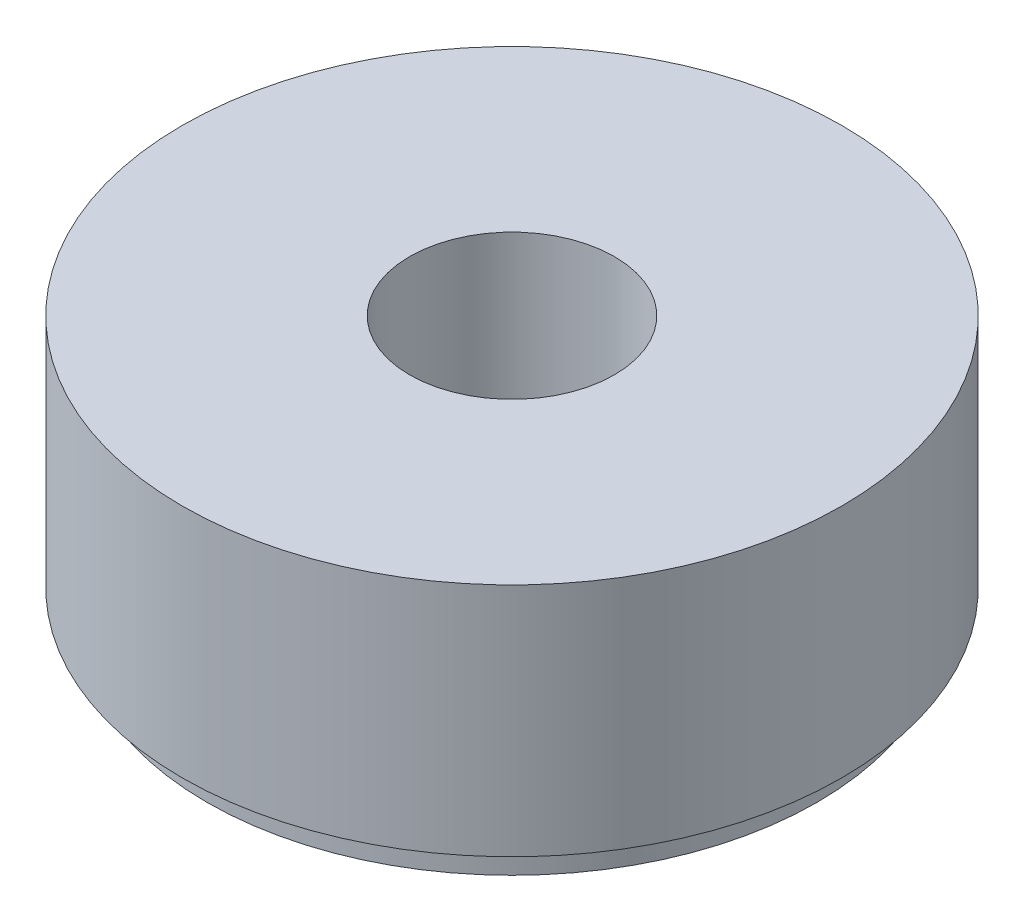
ISO-10303-21;
HEADER;
FILE_DESCRIPTION(('STEP AP214'),'2;1');
FILE_NAME('part.step','',(''),(''),'','','');
FILE_SCHEMA(('AUTOMOTIVE_DESIGN { 1 0 10303 214 1 1 1 1 }'));
ENDSEC;
DATA;
#1=APPLICATION_CONTEXT('core data for automotive mechanical design processes');
#2=APPLICATION_PROTOCOL_DEFINITION('international standard','automotive_design',2000,#1);
#3=PRODUCT_CONTEXT('',#1,'mechanical');
#4=PRODUCT('Part','Part','',(#3));
#5=PRODUCT_RELATED_PRODUCT_CATEGORY('part','',(#4));
#6=PRODUCT_DEFINITION_FORMATION('','',#4);
#7=PRODUCT_DEFINITION_CONTEXT('part definition',#1,'design');
#8=PRODUCT_DEFINITION('design','',#6,#7);
#9=PRODUCT_DEFINITION_SHAPE('','',#8);
#10=(LENGTH_UNIT() NAMED_UNIT(*) SI_UNIT(.MILLI.,.METRE.));
#11=(NAMED_UNIT(*) PLANE_ANGLE_UNIT() SI_UNIT($,.RADIAN.));
#12=(NAMED_UNIT(*) SI_UNIT($,.STERADIAN.) SOLID_ANGLE_UNIT());
#13=UNCERTAINTY_MEASURE_WITH_UNIT(LENGTH_MEASURE(1.E-05),#10,'distance_accuracy_value','');
#14=(GEOMETRIC_REPRESENTATION_CONTEXT(3) GLOBAL_UNCERTAINTY_ASSIGNED_CONTEXT((#13)) GLOBAL_UNIT_ASSIGNED_CONTEXT((#10,
#11,#12)) REPRESENTATION_CONTEXT('',''));
#15=CARTESIAN_POINT('',(0.,0.,0.));
#16=DIRECTION('',(0.,0.,1.));
#17=DIRECTION('',(1.,0.,0.));
#18=AXIS2_PLACEMENT_3D('',#15,#16,#17);
#19=CARTESIAN_POINT('',(0.,2.,0.));
#20=DIRECTION('',(0.,-1.,0.));
#21=DIRECTION('',(0.,0.,-1.));
#22=AXIS2_PLACEMENT_3D('',#19,#20,#21);
#23=CYLINDRICAL_SURFACE('',#22,14.49);
#24=CARTESIAN_POINT('',(0.,2.,0.));
#25=DIRECTION('',(0.,1.,0.));
#26=DIRECTION('',(0.,0.,1.));
#27=AXIS2_PLACEMENT_3D('',#24,#25,#26);
#28=CIRCLE('',#27,14.49);
#29=CARTESIAN_POINT('',(0.,2.,14.49));
#30=VERTEX_POINT('',#29);
#31=EDGE_CURVE('E10',#30,#30,#28,.T.);
#32=ORIENTED_EDGE('',*,*,#31,.F.);
#33=EDGE_LOOP('',(#32));
#34=FACE_BOUND('',#33,.T.);
#35=CARTESIAN_POINT('',(0.,0.,0.));
#36=DIRECTION('',(0.,1.,0.));
#37=DIRECTION('',(0.,0.,1.));
#38=AXIS2_PLACEMENT_3D('',#35,#36,#37);
#39=CIRCLE('',#38,14.49);
#40=CARTESIAN_POINT('',(0.,0.,14.49));
#41=VERTEX_POINT('',#40);
#42=EDGE_CURVE('E46',#41,#41,#39,.T.);
#43=ORIENTED_EDGE('',*,*,#42,.T.);
#44=EDGE_LOOP('',(#43));
#45=FACE_BOUND('',#44,.T.);
#46=ADVANCED_FACE('F43',(#34,#45),#23,.T.);
#47=CARTESIAN_POINT('',(0.,0.,0.));
#48=DIRECTION('',(0.,1.,0.));
#49=DIRECTION('',(0.,0.,1.));
#50=AXIS2_PLACEMENT_3D('',#47,#48,#49);
#51=PLANE('',#50);
#52=CARTESIAN_POINT('',(0.,0.,0.));
#53=DIRECTION('',(0.,-1.,0.));
#54=DIRECTION('',(0.,0.,-1.));
#55=AXIS2_PLACEMENT_3D('',#52,#53,#54);
#56=CIRCLE('',#55,6.13);
#57=CARTESIAN_POINT('',(0.,0.,-6.13));
#58=VERTEX_POINT('',#57);
#59=EDGE_CURVE('E69',#58,#58,#56,.T.);
#60=ORIENTED_EDGE('',*,*,#59,.F.);
#61=EDGE_LOOP('',(#60));
#62=FACE_BOUND('',#61,.T.);
#63=ORIENTED_EDGE('',*,*,#42,.F.);
#64=EDGE_LOOP('',(#63));
#65=FACE_BOUND('',#64,.T.);
#66=ADVANCED_FACE('F83',(#62,#65),#51,.F.);
#67=CARTESIAN_POINT('',(0.,4.,0.));
#68=DIRECTION('',(0.,-1.,0.));
#69=DIRECTION('',(0.,0.,-1.));
#70=AXIS2_PLACEMENT_3D('',#67,#68,#69);
#71=CYLINDRICAL_SURFACE('',#70,18.26);
#72=CARTESIAN_POINT('',(0.,4.,0.));
#73=DIRECTION('',(0.,1.,0.));
#74=DIRECTION('',(0.,0.,1.));
#75=AXIS2_PLACEMENT_3D('',#72,#73,#74);
#76=CIRCLE('',#75,18.26);
#77=CARTESIAN_POINT('',(0.,4.,18.26));
#78=VERTEX_POINT('',#77);
#79=EDGE_CURVE('E55',#78,#78,#76,.T.);
#80=ORIENTED_EDGE('',*,*,#79,.F.);
#81=EDGE_LOOP('',(#80));
#82=FACE_BOUND('',#81,.T.);
#83=CARTESIAN_POINT('',(0.,2.,0.));
#84=DIRECTION('',(0.,1.,0.));
#85=DIRECTION('',(0.,0.,1.));
#86=AXIS2_PLACEMENT_3D('',#83,#84,#85);
#87=CIRCLE('',#86,18.26);
#88=CARTESIAN_POINT('',(0.,2.,18.26));
#89=VERTEX_POINT('',#88);
#90=EDGE_CURVE('E57',#89,#89,#87,.T.);
#91=ORIENTED_EDGE('',*,*,#90,.T.);
#92=EDGE_LOOP('',(#91));
#93=FACE_BOUND('',#92,.T.);
#94=ADVANCED_FACE('F86',(#82,#93),#71,.T.);
#95=CARTESIAN_POINT('',(0.,2.,0.));
#96=DIRECTION('',(0.,1.,0.));
#97=DIRECTION('',(0.,0.,1.));
#98=AXIS2_PLACEMENT_3D('',#95,#96,#97);
#99=PLANE('',#98);
#100=ORIENTED_EDGE('',*,*,#31,.T.);
#101=EDGE_LOOP('',(#100));
#102=FACE_BOUND('',#101,.T.);
#103=ORIENTED_EDGE('',*,*,#90,.F.);
#104=EDGE_LOOP('',(#103));
#105=FACE_BOUND('',#104,.T.);
#106=ADVANCED_FACE('F101',(#102,#105),#99,.F.);
#107=CARTESIAN_POINT('',(0.,18.09,0.));
#108=DIRECTION('',(0.,-1.,0.));
#109=DIRECTION('',(0.,0.,-1.));
#110=AXIS2_PLACEMENT_3D('',#107,#108,#109);
#111=CYLINDRICAL_SURFACE('',#110,19.73);
#112=CARTESIAN_POINT('',(0.,18.09,0.));
#113=DIRECTION('',(0.,1.,0.));
#114=DIRECTION('',(0.,0.,1.));
#115=AXIS2_PLACEMENT_3D('',#112,#113,#114);
#116=CIRCLE('',#115,19.73);
#117=CARTESIAN_POINT('',(0.,18.09,19.73));
#118=VERTEX_POINT('',#117);
#119=EDGE_CURVE('E61',#118,#118,#116,.T.);
#120=ORIENTED_EDGE('',*,*,#119,.F.);
#121=EDGE_LOOP('',(#120));
#122=FACE_BOUND('',#121,.T.);
#123=CARTESIAN_POINT('',(0.,4.,0.));
#124=DIRECTION('',(0.,1.,0.));
#125=DIRECTION('',(0.,0.,1.));
#126=AXIS2_PLACEMENT_3D('',#123,#124,#125);
#127=CIRCLE('',#126,19.73);
#128=CARTESIAN_POINT('',(0.,4.,19.73));
#129=VERTEX_POINT('',#128);
#130=EDGE_CURVE('E65',#129,#129,#127,.T.);
#131=ORIENTED_EDGE('',*,*,#130,.T.);
#132=EDGE_LOOP('',(#131));
#133=FACE_BOUND('',#132,.T.);
#134=ADVANCED_FACE('F110',(#122,#133),#111,.T.);
#135=CARTESIAN_POINT('',(0.,18.09,0.));
#136=DIRECTION('',(0.,1.,0.));
#137=DIRECTION('',(0.,0.,1.));
#138=AXIS2_PLACEMENT_3D('',#135,#136,#137);
#139=PLANE('',#138);
#140=CARTESIAN_POINT('',(0.,18.09,0.));
#141=DIRECTION('',(0.,1.,0.));
#142=DIRECTION('',(0.,0.,1.));
#143=AXIS2_PLACEMENT_3D('',#140,#141,#142);
#144=CIRCLE('',#143,6.13);
#145=CARTESIAN_POINT('',(0.,18.09,6.13));
#146=VERTEX_POINT('',#145);
#147=EDGE_CURVE('E73',#146,#146,#144,.F.);
#148=ORIENTED_EDGE('',*,*,#147,.T.);
#149=EDGE_LOOP('',(#148));
#150=FACE_BOUND('',#149,.T.);
#151=ORIENTED_EDGE('',*,*,#119,.T.);
#152=EDGE_LOOP('',(#151));
#153=FACE_BOUND('',#152,.T.);
#154=ADVANCED_FACE('F118',(#150,#153),#139,.T.);
#155=CARTESIAN_POINT('',(0.,4.,0.));
#156=DIRECTION('',(0.,1.,0.));
#157=DIRECTION('',(0.,0.,1.));
#158=AXIS2_PLACEMENT_3D('',#155,#156,#157);
#159=PLANE('',#158);
#160=ORIENTED_EDGE('',*,*,#79,.T.);
#161=EDGE_LOOP('',(#160));
#162=FACE_BOUND('',#161,.T.);
#163=ORIENTED_EDGE('',*,*,#130,.F.);
#164=EDGE_LOOP('',(#163));
#165=FACE_BOUND('',#164,.T.);
#166=ADVANCED_FACE('F125',(#162,#165),#159,.F.);
#167=CARTESIAN_POINT('',(0.,18.091,0.));
#168=DIRECTION('',(0.,-1.,0.));
#169=DIRECTION('',(0.,0.,-1.));
#170=AXIS2_PLACEMENT_3D('',#167,#168,#169);
#171=CYLINDRICAL_SURFACE('',#170,6.13);
#172=ORIENTED_EDGE('',*,*,#147,.F.);
#173=EDGE_LOOP('',(#172));
#174=FACE_BOUND('',#173,.T.);
#175=ORIENTED_EDGE('',*,*,#59,.T.);
#176=EDGE_LOOP('',(#175));
#177=FACE_BOUND('',#176,.T.);
#178=ADVANCED_FACE('F81',(#174,#177),#171,.F.);
#179=CLOSED_SHELL('',(#46,#66,#94,#106,#134,#154,#166,#178));
#180=MANIFOLD_SOLID_BREP('B2',#179);
#181=ADVANCED_BREP_SHAPE_REPRESENTATION('',(#18,#180),#14);
#182=SHAPE_DEFINITION_REPRESENTATION(#9,#181);
ENDSEC;
END-ISO-10303-21;
